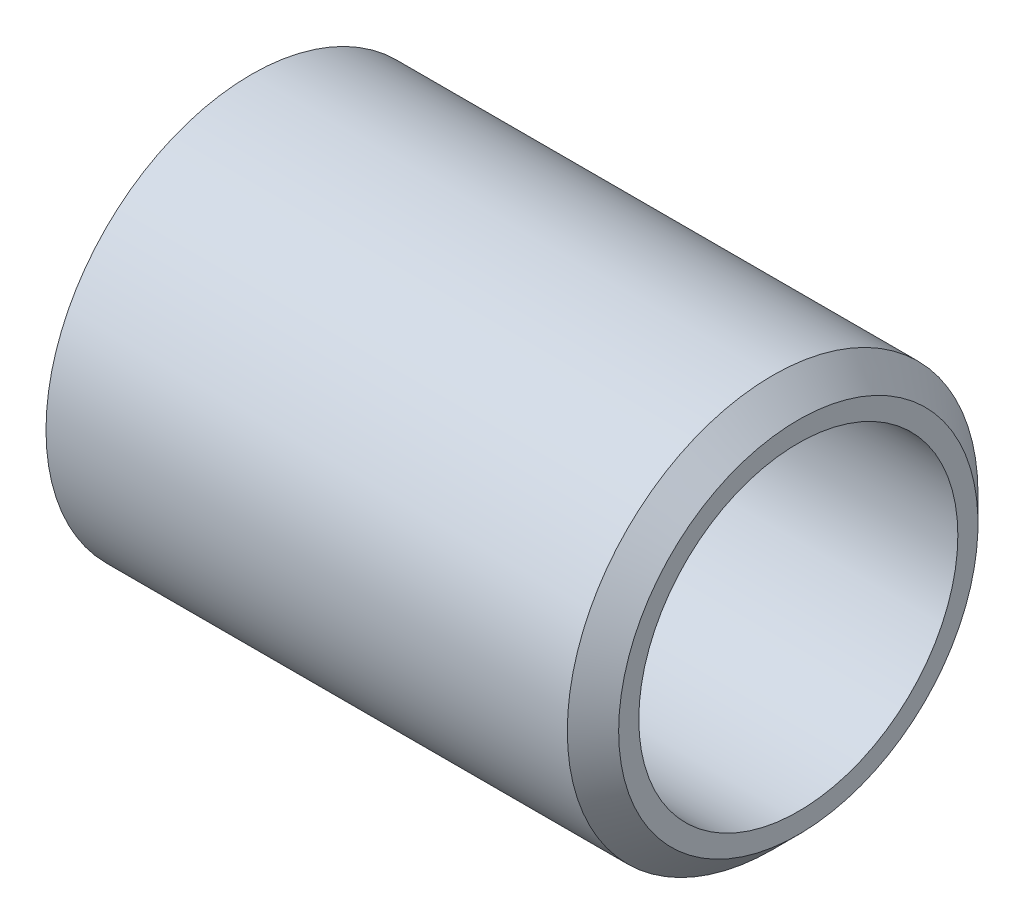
ISO-10303-21;
HEADER;
FILE_DESCRIPTION(('STEP AP214'),'2;1');
FILE_NAME('part.step','',(''),(''),'','','');
FILE_SCHEMA(('AUTOMOTIVE_DESIGN { 1 0 10303 214 1 1 1 1 }'));
ENDSEC;
DATA;
#1=APPLICATION_CONTEXT('core data for automotive mechanical design processes');
#2=APPLICATION_PROTOCOL_DEFINITION('international standard','automotive_design',2000,#1);
#3=PRODUCT_CONTEXT('',#1,'mechanical');
#4=PRODUCT('Part','Part','',(#3));
#5=PRODUCT_RELATED_PRODUCT_CATEGORY('part','',(#4));
#6=PRODUCT_DEFINITION_FORMATION('','',#4);
#7=PRODUCT_DEFINITION_CONTEXT('part definition',#1,'design');
#8=PRODUCT_DEFINITION('design','',#6,#7);
#9=PRODUCT_DEFINITION_SHAPE('','',#8);
#10=(LENGTH_UNIT() NAMED_UNIT(*) SI_UNIT(.MILLI.,.METRE.));
#11=(NAMED_UNIT(*) PLANE_ANGLE_UNIT() SI_UNIT($,.RADIAN.));
#12=(NAMED_UNIT(*) SI_UNIT($,.STERADIAN.) SOLID_ANGLE_UNIT());
#13=UNCERTAINTY_MEASURE_WITH_UNIT(LENGTH_MEASURE(1.E-05),#10,'distance_accuracy_value','');
#14=(GEOMETRIC_REPRESENTATION_CONTEXT(3) GLOBAL_UNCERTAINTY_ASSIGNED_CONTEXT((#13)) GLOBAL_UNIT_ASSIGNED_CONTEXT((#10,
#11,#12)) REPRESENTATION_CONTEXT('',''));
#15=CARTESIAN_POINT('',(0.,0.,0.));
#16=DIRECTION('',(0.,0.,1.));
#17=DIRECTION('',(1.,0.,0.));
#18=AXIS2_PLACEMENT_3D('',#15,#16,#17);
#19=CARTESIAN_POINT('',(0.,0.,0.));
#20=DIRECTION('',(-1.,0.,0.));
#21=DIRECTION('',(0.,0.,1.));
#22=AXIS2_PLACEMENT_3D('',#19,#20,#21);
#23=CYLINDRICAL_SURFACE('',#22,28.60675);
#24=CARTESIAN_POINT('',(72.62415625,0.,0.));
#25=DIRECTION('',(-1.,0.,0.));
#26=DIRECTION('',(0.,0.,1.));
#27=AXIS2_PLACEMENT_3D('',#24,#25,#26);
#28=CIRCLE('',#27,28.60675);
#29=CARTESIAN_POINT('',(72.62415625,0.,28.60675));
#30=VERTEX_POINT('',#29);
#31=EDGE_CURVE('E59',#30,#30,#28,.T.);
#32=ORIENTED_EDGE('',*,*,#31,.T.);
#33=EDGE_LOOP('',(#32));
#34=FACE_BOUND('',#33,.T.);
#35=CARTESIAN_POINT('',(0.,0.,0.));
#36=DIRECTION('',(-1.,0.,0.));
#37=DIRECTION('',(0.,0.,1.));
#38=AXIS2_PLACEMENT_3D('',#35,#36,#37);
#39=CIRCLE('',#38,28.60675);
#40=CARTESIAN_POINT('',(0.,0.,28.60675));
#41=VERTEX_POINT('',#40);
#42=EDGE_CURVE('E10',#41,#41,#39,.T.);
#43=ORIENTED_EDGE('',*,*,#42,.F.);
#44=EDGE_LOOP('',(#43));
#45=FACE_BOUND('',#44,.T.);
#46=ADVANCED_FACE('F37',(#34,#45),#23,.T.);
#47=CARTESIAN_POINT('',(0.,24.6126,0.));
#48=DIRECTION('',(-1.,0.,0.));
#49=DIRECTION('',(0.,0.,1.));
#50=AXIS2_PLACEMENT_3D('',#47,#48,#49);
#51=PLANE('',#50);
#52=ORIENTED_EDGE('',*,*,#42,.T.);
#53=EDGE_LOOP('',(#52));
#54=FACE_BOUND('',#53,.T.);
#55=CARTESIAN_POINT('',(0.,0.,0.));
#56=DIRECTION('',(-1.,0.,0.));
#57=DIRECTION('',(0.,0.,1.));
#58=AXIS2_PLACEMENT_3D('',#55,#56,#57);
#59=CIRCLE('',#58,24.6126);
#60=CARTESIAN_POINT('',(0.,0.,24.6126));
#61=VERTEX_POINT('',#60);
#62=EDGE_CURVE('E43',#61,#61,#59,.T.);
#63=ORIENTED_EDGE('',*,*,#62,.F.);
#64=EDGE_LOOP('',(#63));
#65=FACE_BOUND('',#64,.T.);
#66=ADVANCED_FACE('F77',(#54,#65),#51,.T.);
#67=CARTESIAN_POINT('',(2.3876,0.,0.));
#68=DIRECTION('',(-1.,0.,0.));
#69=DIRECTION('',(0.,0.,1.));
#70=AXIS2_PLACEMENT_3D('',#67,#68,#69);
#71=TOROIDAL_SURFACE('',#70,24.6126,2.3876);
#72=CARTESIAN_POINT('',(2.3876,0.,0.));
#73=DIRECTION('',(-1.,0.,0.));
#74=DIRECTION('',(0.,0.,1.));
#75=AXIS2_PLACEMENT_3D('',#72,#73,#74);
#76=CIRCLE('',#75,22.225);
#77=CARTESIAN_POINT('',(2.3876,0.,22.225));
#78=VERTEX_POINT('',#77);
#79=EDGE_CURVE('E47',#78,#78,#76,.T.);
#80=ORIENTED_EDGE('',*,*,#79,.F.);
#81=EDGE_LOOP('',(#80));
#82=FACE_BOUND('',#81,.T.);
#83=ORIENTED_EDGE('',*,*,#62,.T.);
#84=EDGE_LOOP('',(#83));
#85=FACE_BOUND('',#84,.T.);
#86=ADVANCED_FACE('F81',(#82,#85),#71,.T.);
#87=CARTESIAN_POINT('',(0.,0.,0.));
#88=DIRECTION('',(-1.,0.,0.));
#89=DIRECTION('',(0.,0.,1.));
#90=AXIS2_PLACEMENT_3D('',#87,#88,#89);
#91=CYLINDRICAL_SURFACE('',#90,22.225);
#92=ORIENTED_EDGE('',*,*,#79,.T.);
#93=EDGE_LOOP('',(#92));
#94=FACE_BOUND('',#93,.T.);
#95=CARTESIAN_POINT('',(76.2,0.,0.));
#96=DIRECTION('',(-1.,0.,0.));
#97=DIRECTION('',(0.,0.,1.));
#98=AXIS2_PLACEMENT_3D('',#95,#96,#97);
#99=CIRCLE('',#98,22.225);
#100=CARTESIAN_POINT('',(76.2,0.,22.225));
#101=VERTEX_POINT('',#100);
#102=EDGE_CURVE('E51',#101,#101,#99,.T.);
#103=ORIENTED_EDGE('',*,*,#102,.F.);
#104=EDGE_LOOP('',(#103));
#105=FACE_BOUND('',#104,.T.);
#106=ADVANCED_FACE('F73',(#94,#105),#91,.F.);
#107=CARTESIAN_POINT('',(76.2,25.03090625,0.));
#108=DIRECTION('',(1.,0.,0.));
#109=DIRECTION('',(0.,0.,-1.));
#110=AXIS2_PLACEMENT_3D('',#107,#108,#109);
#111=PLANE('',#110);
#112=ORIENTED_EDGE('',*,*,#102,.T.);
#113=EDGE_LOOP('',(#112));
#114=FACE_BOUND('',#113,.T.);
#115=CARTESIAN_POINT('',(76.2,0.,0.));
#116=DIRECTION('',(-1.,0.,0.));
#117=DIRECTION('',(0.,0.,1.));
#118=AXIS2_PLACEMENT_3D('',#115,#116,#117);
#119=CIRCLE('',#118,25.03090625);
#120=CARTESIAN_POINT('',(76.2,0.,25.03090625));
#121=VERTEX_POINT('',#120);
#122=EDGE_CURVE('E56',#121,#121,#119,.T.);
#123=ORIENTED_EDGE('',*,*,#122,.F.);
#124=EDGE_LOOP('',(#123));
#125=FACE_BOUND('',#124,.T.);
#126=ADVANCED_FACE('F67',(#114,#125),#111,.T.);
#127=CARTESIAN_POINT('',(72.62415625,0.,0.));
#128=DIRECTION('',(-1.,0.,0.));
#129=DIRECTION('',(0.,0.,1.));
#130=AXIS2_PLACEMENT_3D('',#127,#128,#129);
#131=CONICAL_SURFACE('',#130,28.60675,0.785398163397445);
#132=ORIENTED_EDGE('',*,*,#122,.T.);
#133=EDGE_LOOP('',(#132));
#134=FACE_BOUND('',#133,.T.);
#135=ORIENTED_EDGE('',*,*,#31,.F.);
#136=EDGE_LOOP('',(#135));
#137=FACE_BOUND('',#136,.T.);
#138=ADVANCED_FACE('F65',(#134,#137),#131,.T.);
#139=CLOSED_SHELL('',(#46,#66,#86,#106,#126,#138));
#140=MANIFOLD_SOLID_BREP('B2',#139);
#141=ADVANCED_BREP_SHAPE_REPRESENTATION('',(#18,#140),#14);
#142=SHAPE_DEFINITION_REPRESENTATION(#9,#141);
ENDSEC;
END-ISO-10303-21;
